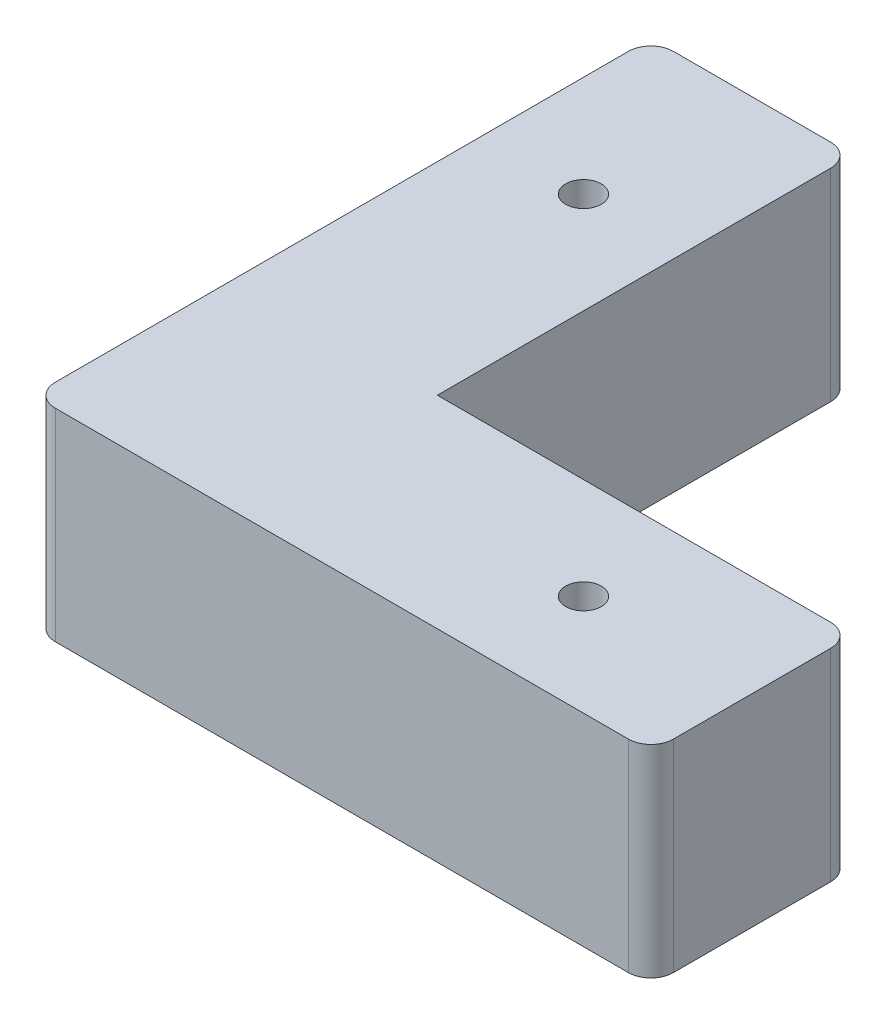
from build123d import *

# Parameters (mm, degrees)
ESQUISSE1_R        = 1.585
BOSS_EXTRU_1_DEPTH = 9
CONG_1_R           = 2


with BuildPart() as part:
    # Esquisse1 → Boss.-Extru.1 (new, symmetric)
    with BuildSketch(Plane(origin=(0, 0, 0), x_dir=(1, 0, 0), z_dir=(0, 1, 0))):
        Polygon((0, 55), (0, 0), (55, 0), (55, 18), (18, 18), (18, 55), align=None)
        with Locations(Location((9, 40, 0), (0, 0, 270))):
            Circle(ESQUISSE1_R, mode=Mode.SUBTRACT)
        with Locations(Location((40, 9, 0), (0, 0, 270))):
            Circle(ESQUISSE1_R, mode=Mode.SUBTRACT)
    extrude(amount=BOSS_EXTRU_1_DEPTH, both=True)

    # Cong_1
    cong_1_edges = [part.edges().sort_by_distance(p)[0] for p in [
        (18, 0, -55),
        (55, 0, -18),
        (55, 0, 0),
        (0, 0, 0),
        (0, 0, -55),
    ]]
    fillet(cong_1_edges, radius=CONG_1_R)


solid = part.part
